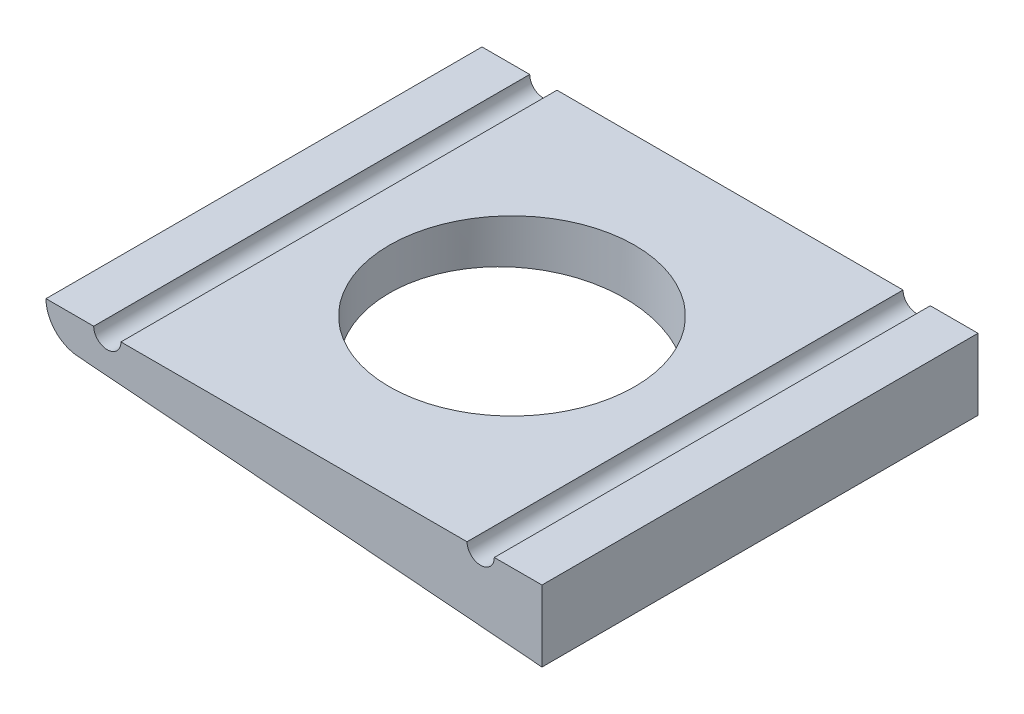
ISO-10303-21;
HEADER;
FILE_DESCRIPTION(('STEP AP214'),'2;1');
FILE_NAME('part.step','',(''),(''),'','','');
FILE_SCHEMA(('AUTOMOTIVE_DESIGN { 1 0 10303 214 1 1 1 1 }'));
ENDSEC;
DATA;
#1=APPLICATION_CONTEXT('core data for automotive mechanical design processes');
#2=APPLICATION_PROTOCOL_DEFINITION('international standard','automotive_design',2000,#1);
#3=PRODUCT_CONTEXT('',#1,'mechanical');
#4=PRODUCT('Part','Part','',(#3));
#5=PRODUCT_RELATED_PRODUCT_CATEGORY('part','',(#4));
#6=PRODUCT_DEFINITION_FORMATION('','',#4);
#7=PRODUCT_DEFINITION_CONTEXT('part definition',#1,'design');
#8=PRODUCT_DEFINITION('design','',#6,#7);
#9=PRODUCT_DEFINITION_SHAPE('','',#8);
#10=(LENGTH_UNIT() NAMED_UNIT(*) SI_UNIT(.MILLI.,.METRE.));
#11=(NAMED_UNIT(*) PLANE_ANGLE_UNIT() SI_UNIT($,.RADIAN.));
#12=(NAMED_UNIT(*) SI_UNIT($,.STERADIAN.) SOLID_ANGLE_UNIT());
#13=UNCERTAINTY_MEASURE_WITH_UNIT(LENGTH_MEASURE(1.E-05),#10,'distance_accuracy_value','');
#14=(GEOMETRIC_REPRESENTATION_CONTEXT(3) GLOBAL_UNCERTAINTY_ASSIGNED_CONTEXT((#13)) GLOBAL_UNIT_ASSIGNED_CONTEXT((#10,
#11,#12)) REPRESENTATION_CONTEXT('',''));
#15=CARTESIAN_POINT('',(0.,0.,0.));
#16=DIRECTION('',(0.,0.,1.));
#17=DIRECTION('',(1.,0.,0.));
#18=AXIS2_PLACEMENT_3D('',#15,#16,#17);
#19=CARTESIAN_POINT('',(13.6999999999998,1.94289029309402E-13,16.));
#20=DIRECTION('',(0.,0.,-1.));
#21=DIRECTION('',(-1.,0.,0.));
#22=AXIS2_PLACEMENT_3D('',#19,#20,#21);
#23=CYLINDRICAL_SURFACE('',#22,1.);
#24=CARTESIAN_POINT('',(13.7000000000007,0.,-15.9999999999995));
#25=DIRECTION('',(0.,0.,-1.));
#26=DIRECTION('',(1.,0.,0.));
#27=AXIS2_PLACEMENT_3D('',#24,#25,#26);
#28=CIRCLE('',#27,1.);
#29=CARTESIAN_POINT('',(14.7000000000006,-1.94289029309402E-13,-16.0000000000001));
#30=VERTEX_POINT('',#29);
#31=CARTESIAN_POINT('',(12.7000000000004,0.,-15.9999999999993));
#32=VERTEX_POINT('',#31);
#33=EDGE_CURVE('E99',#30,#32,#28,.T.);
#34=ORIENTED_EDGE('',*,*,#33,.T.);
#35=DIRECTION('',(0.,0.,-1.));
#36=VECTOR('',#35,1.);
#37=CARTESIAN_POINT('',(12.6999999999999,0.,16.0000000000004));
#38=LINE('',#37,#36);
#39=CARTESIAN_POINT('',(12.6999999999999,0.,16.0000000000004));
#40=VERTEX_POINT('',#39);
#41=EDGE_CURVE('E11',#40,#32,#38,.T.);
#42=ORIENTED_EDGE('',*,*,#41,.F.);
#43=CARTESIAN_POINT('',(13.6999999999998,1.94289029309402E-13,16.));
#44=DIRECTION('',(0.,0.,-1.));
#45=DIRECTION('',(1.,0.,0.));
#46=AXIS2_PLACEMENT_3D('',#43,#44,#45);
#47=CIRCLE('',#46,1.);
#48=CARTESIAN_POINT('',(14.6999999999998,-1.11022302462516E-13,16.0000000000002));
#49=VERTEX_POINT('',#48);
#50=EDGE_CURVE('E129',#49,#40,#47,.T.);
#51=ORIENTED_EDGE('',*,*,#50,.F.);
#52=DIRECTION('',(0.,0.,-1.));
#53=VECTOR('',#52,1.);
#54=CARTESIAN_POINT('',(14.6999999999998,-1.11022302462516E-13,16.0000000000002));
#55=LINE('',#54,#53);
#56=EDGE_CURVE('E112',#49,#30,#55,.T.);
#57=ORIENTED_EDGE('',*,*,#56,.T.);
#58=EDGE_LOOP('',(#34,#42,#51,#57));
#59=FACE_BOUND('',#58,.T.);
#60=ADVANCED_FACE('F30',(#59),#23,.F.);
#61=CARTESIAN_POINT('',(-12.6999999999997,-1.94289029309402E-13,16.0000000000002));
#62=DIRECTION('',(0.,-1.,0.));
#63=DIRECTION('',(1.,0.,0.));
#64=AXIS2_PLACEMENT_3D('',#61,#62,#63);
#65=PLANE('',#64);
#66=CARTESIAN_POINT('',(0.,0.,0.));
#67=DIRECTION('',(0.,1.,0.));
#68=DIRECTION('',(-1.,0.,0.));
#69=AXIS2_PLACEMENT_3D('',#66,#67,#68);
#70=CIRCLE('',#69,9.);
#71=CARTESIAN_POINT('',(-9.00000000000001,0.,0.));
#72=VERTEX_POINT('',#71);
#73=EDGE_CURVE('E115',#72,#72,#70,.T.);
#74=ORIENTED_EDGE('',*,*,#73,.F.);
#75=EDGE_LOOP('',(#74));
#76=FACE_BOUND('',#75,.T.);
#77=DIRECTION('',(-1.,0.,0.));
#78=VECTOR('',#77,1.);
#79=CARTESIAN_POINT('',(-12.6999999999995,0.,-15.9999999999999));
#80=LINE('',#79,#78);
#81=CARTESIAN_POINT('',(-12.6999999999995,0.,-15.9999999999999));
#82=VERTEX_POINT('',#81);
#83=EDGE_CURVE('E95',#32,#82,#80,.T.);
#84=ORIENTED_EDGE('',*,*,#83,.T.);
#85=DIRECTION('',(0.,0.,-1.));
#86=VECTOR('',#85,1.);
#87=CARTESIAN_POINT('',(-12.6999999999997,-1.94289029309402E-13,16.0000000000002));
#88=LINE('',#87,#86);
#89=CARTESIAN_POINT('',(-12.6999999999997,-1.94289029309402E-13,16.0000000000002));
#90=VERTEX_POINT('',#89);
#91=EDGE_CURVE('E38',#90,#82,#88,.T.);
#92=ORIENTED_EDGE('',*,*,#91,.F.);
#93=DIRECTION('',(-1.,0.,0.));
#94=VECTOR('',#93,1.);
#95=CARTESIAN_POINT('',(-12.6999999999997,-1.94289029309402E-13,16.0000000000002));
#96=LINE('',#95,#94);
#97=EDGE_CURVE('E108',#40,#90,#96,.T.);
#98=ORIENTED_EDGE('',*,*,#97,.F.);
#99=ORIENTED_EDGE('',*,*,#41,.T.);
#100=EDGE_LOOP('',(#84,#92,#98,#99));
#101=FACE_BOUND('',#100,.T.);
#102=ADVANCED_FACE('F107',(#76,#101),#65,.F.);
#103=CARTESIAN_POINT('',(-13.6999999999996,0.,16.));
#104=DIRECTION('',(0.,0.,-1.));
#105=DIRECTION('',(-1.,0.,0.));
#106=AXIS2_PLACEMENT_3D('',#103,#104,#105);
#107=CYLINDRICAL_SURFACE('',#106,1.);
#108=CARTESIAN_POINT('',(-13.6999999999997,-1.38777878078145E-13,-15.9999999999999));
#109=DIRECTION('',(0.,0.,-1.));
#110=DIRECTION('',(-1.,0.,0.));
#111=AXIS2_PLACEMENT_3D('',#108,#109,#110);
#112=CIRCLE('',#111,1.);
#113=CARTESIAN_POINT('',(-14.6999999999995,0.,-16.0000000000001));
#114=VERTEX_POINT('',#113);
#115=EDGE_CURVE('E101',#82,#114,#112,.T.);
#116=ORIENTED_EDGE('',*,*,#115,.T.);
#117=DIRECTION('',(0.,0.,-1.));
#118=VECTOR('',#117,1.);
#119=CARTESIAN_POINT('',(-14.6999999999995,-2.4980018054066E-13,16.0000000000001));
#120=LINE('',#119,#118);
#121=CARTESIAN_POINT('',(-14.6999999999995,-2.4980018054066E-13,16.0000000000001));
#122=VERTEX_POINT('',#121);
#123=EDGE_CURVE('E155',#122,#114,#120,.T.);
#124=ORIENTED_EDGE('',*,*,#123,.F.);
#125=CARTESIAN_POINT('',(-13.6999999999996,0.,16.));
#126=DIRECTION('',(0.,0.,-1.));
#127=DIRECTION('',(-1.,0.,0.));
#128=AXIS2_PLACEMENT_3D('',#125,#126,#127);
#129=CIRCLE('',#128,1.);
#130=EDGE_CURVE('E132',#90,#122,#129,.T.);
#131=ORIENTED_EDGE('',*,*,#130,.F.);
#132=ORIENTED_EDGE('',*,*,#91,.T.);
#133=EDGE_LOOP('',(#116,#124,#131,#132));
#134=FACE_BOUND('',#133,.T.);
#135=ADVANCED_FACE('F160',(#134),#107,.F.);
#136=CARTESIAN_POINT('',(-14.6999999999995,-2.4980018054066E-13,16.0000000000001));
#137=DIRECTION('',(0.,-1.,0.));
#138=DIRECTION('',(1.,0.,0.));
#139=AXIS2_PLACEMENT_3D('',#136,#137,#138);
#140=PLANE('',#139);
#141=DIRECTION('',(-1.,0.,0.));
#142=VECTOR('',#141,1.);
#143=CARTESIAN_POINT('',(-14.6999999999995,0.,-16.0000000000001));
#144=LINE('',#143,#142);
#145=CARTESIAN_POINT('',(-18.1999999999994,1.38777878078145E-13,-16.));
#146=VERTEX_POINT('',#145);
#147=EDGE_CURVE('E119',#114,#146,#144,.T.);
#148=ORIENTED_EDGE('',*,*,#147,.T.);
#149=DIRECTION('',(0.,0.,-1.));
#150=VECTOR('',#149,1.);
#151=CARTESIAN_POINT('',(-18.1999999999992,0.,16.0000000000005));
#152=LINE('',#151,#150);
#153=CARTESIAN_POINT('',(-18.1999999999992,0.,16.0000000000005));
#154=VERTEX_POINT('',#153);
#155=EDGE_CURVE('E152',#154,#146,#152,.T.);
#156=ORIENTED_EDGE('',*,*,#155,.F.);
#157=DIRECTION('',(-1.,0.,0.));
#158=VECTOR('',#157,1.);
#159=CARTESIAN_POINT('',(-14.6999999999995,-2.4980018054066E-13,16.0000000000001));
#160=LINE('',#159,#158);
#161=EDGE_CURVE('E134',#122,#154,#160,.T.);
#162=ORIENTED_EDGE('',*,*,#161,.F.);
#163=ORIENTED_EDGE('',*,*,#123,.T.);
#164=EDGE_LOOP('',(#148,#156,#162,#163));
#165=FACE_BOUND('',#164,.T.);
#166=ADVANCED_FACE('F168',(#165),#140,.F.);
#167=CARTESIAN_POINT('',(-15.6999999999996,-1.94289029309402E-13,16.));
#168=DIRECTION('',(0.,0.,-1.));
#169=DIRECTION('',(-1.,0.,0.));
#170=AXIS2_PLACEMENT_3D('',#167,#168,#169);
#171=CYLINDRICAL_SURFACE('',#170,2.5);
#172=CARTESIAN_POINT('',(-15.6999999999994,0.,-16.));
#173=DIRECTION('',(0.,0.,1.));
#174=DIRECTION('',(1.,0.,0.));
#175=AXIS2_PLACEMENT_3D('',#172,#173,#174);
#176=CIRCLE('',#175,2.5);
#177=CARTESIAN_POINT('',(-15.8991925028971,-2.49205183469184,-16.));
#178=VERTEX_POINT('',#177);
#179=EDGE_CURVE('E121',#146,#178,#176,.T.);
#180=ORIENTED_EDGE('',*,*,#179,.T.);
#181=DIRECTION('',(0.,0.,-1.));
#182=VECTOR('',#181,1.);
#183=CARTESIAN_POINT('',(-15.8991925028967,-2.49205183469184,15.9999999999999));
#184=LINE('',#183,#182);
#185=CARTESIAN_POINT('',(-15.8991925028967,-2.49205183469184,15.9999999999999));
#186=VERTEX_POINT('',#185);
#187=EDGE_CURVE('E149',#186,#178,#184,.T.);
#188=ORIENTED_EDGE('',*,*,#187,.F.);
#189=CARTESIAN_POINT('',(-15.6999999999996,-1.94289029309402E-13,16.));
#190=DIRECTION('',(0.,0.,1.));
#191=DIRECTION('',(1.,0.,0.));
#192=AXIS2_PLACEMENT_3D('',#189,#190,#191);
#193=CIRCLE('',#192,2.5);
#194=EDGE_CURVE('E136',#154,#186,#193,.T.);
#195=ORIENTED_EDGE('',*,*,#194,.F.);
#196=ORIENTED_EDGE('',*,*,#155,.T.);
#197=EDGE_LOOP('',(#180,#188,#195,#196));
#198=FACE_BOUND('',#197,.T.);
#199=ADVANCED_FACE('F171',(#198),#171,.T.);
#200=CARTESIAN_POINT('',(-15.8991925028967,-2.49205183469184,15.9999999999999));
#201=DIRECTION('',(0.079677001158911,0.996820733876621,0.));
#202=DIRECTION('',(-0.996820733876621,0.079677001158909,0.));
#203=AXIS2_PLACEMENT_3D('',#200,#201,#202);
#204=PLANE('',#203);
#205=CARTESIAN_POINT('',(1.11022302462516E-13,-3.76289215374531,1.94289029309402E-13));
#206=DIRECTION('',(0.079677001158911,0.996820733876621,0.));
#207=DIRECTION('',(-0.996820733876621,0.079677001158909,0.));
#208=AXIS2_PLACEMENT_3D('',#205,#206,#207);
#209=ELLIPSE('',#208,9.02870465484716,9.);
#210=CARTESIAN_POINT('',(-8.9999999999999,-3.04351204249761,2.14837974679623E-13));
#211=VERTEX_POINT('',#210);
#212=EDGE_CURVE('E33',#211,#211,#209,.T.);
#213=ORIENTED_EDGE('',*,*,#212,.T.);
#214=EDGE_LOOP('',(#213));
#215=FACE_BOUND('',#214,.T.);
#216=DIRECTION('',(0.996820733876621,-0.079677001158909,0.));
#217=VECTOR('',#216,1.);
#218=CARTESIAN_POINT('',(-15.8991925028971,-2.49205183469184,-16.));
#219=LINE('',#218,#217);
#220=CARTESIAN_POINT('',(18.2000000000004,-5.21763860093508,-16.));
#221=VERTEX_POINT('',#220);
#222=EDGE_CURVE('E123',#178,#221,#219,.T.);
#223=ORIENTED_EDGE('',*,*,#222,.T.);
#224=DIRECTION('',(0.,0.,-1.));
#225=VECTOR('',#224,1.);
#226=CARTESIAN_POINT('',(18.2000000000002,-5.21763860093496,16.));
#227=LINE('',#226,#225);
#228=CARTESIAN_POINT('',(18.2000000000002,-5.21763860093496,16.));
#229=VERTEX_POINT('',#228);
#230=EDGE_CURVE('E146',#229,#221,#227,.T.);
#231=ORIENTED_EDGE('',*,*,#230,.F.);
#232=DIRECTION('',(0.996820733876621,-0.079677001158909,0.));
#233=VECTOR('',#232,1.);
#234=CARTESIAN_POINT('',(-15.8991925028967,-2.49205183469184,15.9999999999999));
#235=LINE('',#234,#233);
#236=EDGE_CURVE('E138',#186,#229,#235,.T.);
#237=ORIENTED_EDGE('',*,*,#236,.F.);
#238=ORIENTED_EDGE('',*,*,#187,.T.);
#239=EDGE_LOOP('',(#223,#231,#237,#238));
#240=FACE_BOUND('',#239,.T.);
#241=ADVANCED_FACE('F176',(#215,#240),#204,.F.);
#242=CARTESIAN_POINT('',(18.2000000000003,0.,15.9999999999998));
#243=DIRECTION('',(-1.,0.,0.));
#244=DIRECTION('',(0.,0.,1.));
#245=AXIS2_PLACEMENT_3D('',#242,#243,#244);
#246=PLANE('',#245);
#247=DIRECTION('',(0.,1.,0.));
#248=VECTOR('',#247,1.);
#249=CARTESIAN_POINT('',(18.2000000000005,1.11022302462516E-13,-16.0000000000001));
#250=LINE('',#249,#248);
#251=CARTESIAN_POINT('',(18.2000000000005,1.11022302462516E-13,-16.0000000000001));
#252=VERTEX_POINT('',#251);
#253=EDGE_CURVE('E125',#221,#252,#250,.T.);
#254=ORIENTED_EDGE('',*,*,#253,.T.);
#255=DIRECTION('',(0.,0.,-1.));
#256=VECTOR('',#255,1.);
#257=CARTESIAN_POINT('',(18.2000000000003,0.,15.9999999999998));
#258=LINE('',#257,#256);
#259=CARTESIAN_POINT('',(18.2000000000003,0.,15.9999999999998));
#260=VERTEX_POINT('',#259);
#261=EDGE_CURVE('E143',#260,#252,#258,.T.);
#262=ORIENTED_EDGE('',*,*,#261,.F.);
#263=DIRECTION('',(0.,1.,0.));
#264=VECTOR('',#263,1.);
#265=CARTESIAN_POINT('',(18.2000000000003,0.,15.9999999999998));
#266=LINE('',#265,#264);
#267=EDGE_CURVE('E50',#229,#260,#266,.T.);
#268=ORIENTED_EDGE('',*,*,#267,.F.);
#269=ORIENTED_EDGE('',*,*,#230,.T.);
#270=EDGE_LOOP('',(#254,#262,#268,#269));
#271=FACE_BOUND('',#270,.T.);
#272=ADVANCED_FACE('F179',(#271),#246,.F.);
#273=CARTESIAN_POINT('',(14.6999999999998,-1.11022302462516E-13,16.0000000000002));
#274=DIRECTION('',(0.,-1.,0.));
#275=DIRECTION('',(1.,0.,0.));
#276=AXIS2_PLACEMENT_3D('',#273,#274,#275);
#277=PLANE('',#276);
#278=DIRECTION('',(-1.,0.,0.));
#279=VECTOR('',#278,1.);
#280=CARTESIAN_POINT('',(14.7000000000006,-1.94289029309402E-13,-16.0000000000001));
#281=LINE('',#280,#279);
#282=EDGE_CURVE('E127',#252,#30,#281,.T.);
#283=ORIENTED_EDGE('',*,*,#282,.T.);
#284=ORIENTED_EDGE('',*,*,#56,.F.);
#285=DIRECTION('',(-1.,0.,0.));
#286=VECTOR('',#285,1.);
#287=CARTESIAN_POINT('',(14.6999999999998,-1.11022302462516E-13,16.0000000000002));
#288=LINE('',#287,#286);
#289=EDGE_CURVE('E45',#260,#49,#288,.T.);
#290=ORIENTED_EDGE('',*,*,#289,.F.);
#291=ORIENTED_EDGE('',*,*,#261,.T.);
#292=EDGE_LOOP('',(#283,#284,#290,#291));
#293=FACE_BOUND('',#292,.T.);
#294=ADVANCED_FACE('F181',(#293),#277,.F.);
#295=CARTESIAN_POINT('',(13.6999999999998,1.94289029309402E-13,16.));
#296=DIRECTION('',(0.,0.,1.));
#297=DIRECTION('',(1.,0.,0.));
#298=AXIS2_PLACEMENT_3D('',#295,#296,#297);
#299=PLANE('',#298);
#300=ORIENTED_EDGE('',*,*,#50,.T.);
#301=ORIENTED_EDGE('',*,*,#97,.T.);
#302=ORIENTED_EDGE('',*,*,#130,.T.);
#303=ORIENTED_EDGE('',*,*,#161,.T.);
#304=ORIENTED_EDGE('',*,*,#194,.T.);
#305=ORIENTED_EDGE('',*,*,#236,.T.);
#306=ORIENTED_EDGE('',*,*,#267,.T.);
#307=ORIENTED_EDGE('',*,*,#289,.T.);
#308=EDGE_LOOP('',(#300,#301,#302,#303,#304,#305,#306,#307));
#309=FACE_BOUND('',#308,.T.);
#310=ADVANCED_FACE('F163',(#309),#299,.T.);
#311=CARTESIAN_POINT('',(13.7000000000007,0.,-15.9999999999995));
#312=DIRECTION('',(0.,0.,1.));
#313=DIRECTION('',(1.,0.,0.));
#314=AXIS2_PLACEMENT_3D('',#311,#312,#313);
#315=PLANE('',#314);
#316=ORIENTED_EDGE('',*,*,#33,.F.);
#317=ORIENTED_EDGE('',*,*,#282,.F.);
#318=ORIENTED_EDGE('',*,*,#253,.F.);
#319=ORIENTED_EDGE('',*,*,#222,.F.);
#320=ORIENTED_EDGE('',*,*,#179,.F.);
#321=ORIENTED_EDGE('',*,*,#147,.F.);
#322=ORIENTED_EDGE('',*,*,#115,.F.);
#323=ORIENTED_EDGE('',*,*,#83,.F.);
#324=EDGE_LOOP('',(#316,#317,#318,#319,#320,#321,#322,#323));
#325=FACE_BOUND('',#324,.T.);
#326=ADVANCED_FACE('F96',(#325),#315,.F.);
#327=CARTESIAN_POINT('',(0.,-5.21763860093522,0.));
#328=DIRECTION('',(0.,1.,0.));
#329=DIRECTION('',(-1.,0.,0.));
#330=AXIS2_PLACEMENT_3D('',#327,#328,#329);
#331=CYLINDRICAL_SURFACE('',#330,9.);
#332=ORIENTED_EDGE('',*,*,#73,.T.);
#333=EDGE_LOOP('',(#332));
#334=FACE_BOUND('',#333,.T.);
#335=ORIENTED_EDGE('',*,*,#212,.F.);
#336=EDGE_LOOP('',(#335));
#337=FACE_BOUND('',#336,.T.);
#338=ADVANCED_FACE('F211',(#334,#337),#331,.F.);
#339=CLOSED_SHELL('',(#60,#102,#135,#166,#199,#241,#272,#294,#310,#326,#338));
#340=MANIFOLD_SOLID_BREP('B2',#339);
#341=ADVANCED_BREP_SHAPE_REPRESENTATION('',(#18,#340),#14);
#342=SHAPE_DEFINITION_REPRESENTATION(#9,#341);
ENDSEC;
END-ISO-10303-21;
